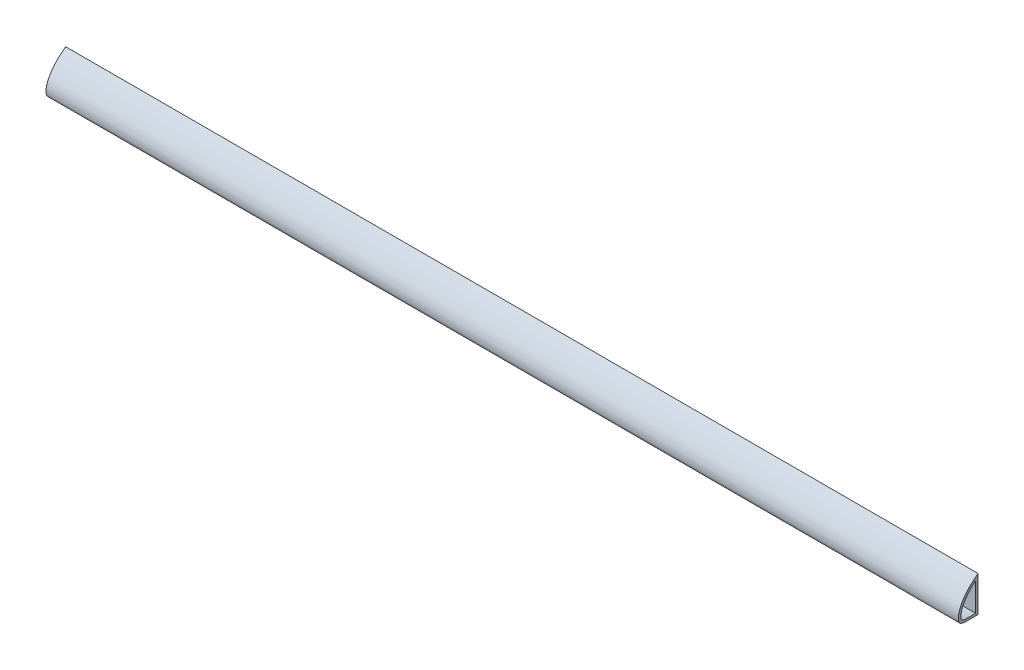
ISO-10303-21;
HEADER;
FILE_DESCRIPTION(('STEP AP214'),'2;1');
FILE_NAME('part.step','',(''),(''),'','','');
FILE_SCHEMA(('AUTOMOTIVE_DESIGN { 1 0 10303 214 1 1 1 1 }'));
ENDSEC;
DATA;
#1=APPLICATION_CONTEXT('core data for automotive mechanical design processes');
#2=APPLICATION_PROTOCOL_DEFINITION('international standard','automotive_design',2000,#1);
#3=PRODUCT_CONTEXT('',#1,'mechanical');
#4=PRODUCT('Part','Part','',(#3));
#5=PRODUCT_RELATED_PRODUCT_CATEGORY('part','',(#4));
#6=PRODUCT_DEFINITION_FORMATION('','',#4);
#7=PRODUCT_DEFINITION_CONTEXT('part definition',#1,'design');
#8=PRODUCT_DEFINITION('design','',#6,#7);
#9=PRODUCT_DEFINITION_SHAPE('','',#8);
#10=(LENGTH_UNIT() NAMED_UNIT(*) SI_UNIT(.MILLI.,.METRE.));
#11=(NAMED_UNIT(*) PLANE_ANGLE_UNIT() SI_UNIT($,.RADIAN.));
#12=(NAMED_UNIT(*) SI_UNIT($,.STERADIAN.) SOLID_ANGLE_UNIT());
#13=UNCERTAINTY_MEASURE_WITH_UNIT(LENGTH_MEASURE(1.E-05),#10,'distance_accuracy_value','');
#14=(GEOMETRIC_REPRESENTATION_CONTEXT(3) GLOBAL_UNCERTAINTY_ASSIGNED_CONTEXT((#13)) GLOBAL_UNIT_ASSIGNED_CONTEXT((#10,
#11,#12)) REPRESENTATION_CONTEXT('',''));
#15=CARTESIAN_POINT('',(0.,0.,0.));
#16=DIRECTION('',(0.,0.,1.));
#17=DIRECTION('',(1.,0.,0.));
#18=AXIS2_PLACEMENT_3D('',#15,#16,#17);
#19=CARTESIAN_POINT('',(147.6375,1.90916005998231,-0.33356018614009));
#20=DIRECTION('',(-1.,0.,0.));
#21=DIRECTION('',(0.,0.,1.));
#22=AXIS2_PLACEMENT_3D('',#19,#20,#21);
#23=PLANE('',#22);
#24=CARTESIAN_POINT('',(147.6375,9.31142365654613,-6.35));
#25=CARTESIAN_POINT('',(147.6375,9.13251287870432,-6.10940572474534));
#26=CARTESIAN_POINT('',(147.6375,8.49619410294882,-5.27830195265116));
#27=CARTESIAN_POINT('',(147.6375,7.38289954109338,-3.96958394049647));
#28=CARTESIAN_POINT('',(147.6375,5.91107497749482,-2.57710308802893));
#29=CARTESIAN_POINT('',(147.6375,4.43364850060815,-1.50738075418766));
#30=CARTESIAN_POINT('',(147.6375,2.99622308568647,-0.717084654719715));
#31=CARTESIAN_POINT('',(147.6375,1.63137185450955,-0.210435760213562));
#32=CARTESIAN_POINT('',(147.6375,0.371536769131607,0.031192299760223));
#33=CARTESIAN_POINT('',(147.6375,-0.694071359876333,-0.0149978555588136));
#34=CARTESIAN_POINT('',(147.6375,-1.67148547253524,-0.289002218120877));
#35=CARTESIAN_POINT('',(147.6375,-2.15698520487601,-1.30860402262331));
#36=CARTESIAN_POINT('',(147.6375,-2.22552208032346,-2.67967317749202));
#37=CARTESIAN_POINT('',(147.6375,-2.28727419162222,-4.41839355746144));
#38=CARTESIAN_POINT('',(147.6375,-2.24222608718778,-5.69787493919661));
#39=CARTESIAN_POINT('',(147.6375,-2.21046306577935,-6.35));
#40=B_SPLINE_CURVE_WITH_KNOTS('',3,(#24,#25,#26,#27,#28,#29,#30,#31,#32,#33,#34,#35,#36,#37,#38,
#39),.UNSPECIFIED.,.F.,.F.,(4,1,1,1,1,1,1,1,1,1,1,1,1,4),(0.473049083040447,0.475988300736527,
0.48330896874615,0.489874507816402,0.495803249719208,0.501149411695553,0.50590307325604,
0.510046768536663,0.513579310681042,0.516446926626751,0.519350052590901,0.523823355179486,
0.529973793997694,0.536375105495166),.UNSPECIFIED.);
#41=CARTESIAN_POINT('',(147.6375,9.31142365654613,-6.35));
#42=VERTEX_POINT('',#41);
#43=CARTESIAN_POINT('',(147.6375,-2.21046306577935,-6.35));
#44=VERTEX_POINT('',#43);
#45=EDGE_CURVE('E118',#42,#44,#40,.T.);
#46=ORIENTED_EDGE('',*,*,#45,.T.);
#47=DIRECTION('',(0.,1.,0.));
#48=VECTOR('',#47,1.);
#49=CARTESIAN_POINT('',(147.6375,9.31142365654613,-6.35));
#50=LINE('',#49,#48);
#51=EDGE_CURVE('E122',#44,#42,#50,.T.);
#52=ORIENTED_EDGE('',*,*,#51,.T.);
#53=EDGE_LOOP('',(#46,#52));
#54=FACE_BOUND('',#53,.T.);
#55=CARTESIAN_POINT('',(147.6375,7.67798740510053,-5.55625000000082));
#56=CARTESIAN_POINT('',(147.6375,7.24256500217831,-5.03436126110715));
#57=CARTESIAN_POINT('',(147.6375,6.32227000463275,-4.01853736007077));
#58=CARTESIAN_POINT('',(147.6375,4.80393100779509,-2.70742646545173));
#59=CARTESIAN_POINT('',(147.6375,3.38731761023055,-1.80935606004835));
#60=CARTESIAN_POINT('',(147.6375,2.20087156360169,-1.2616477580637));
#61=CARTESIAN_POINT('',(147.6375,1.28068475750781,-0.954864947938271));
#62=CARTESIAN_POINT('',(147.6375,0.508823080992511,-0.808236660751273));
#63=CARTESIAN_POINT('',(147.6375,-0.0740297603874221,-0.786056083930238));
#64=CARTESIAN_POINT('',(147.6375,-0.506497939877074,-0.81982907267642));
#65=CARTESIAN_POINT('',(147.6375,-0.872935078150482,-0.893336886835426));
#66=CARTESIAN_POINT('',(147.6375,-1.03771034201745,-0.966729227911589));
#67=CARTESIAN_POINT('',(147.6375,-1.07749251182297,-0.994978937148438));
#68=CARTESIAN_POINT('',(147.6375,-1.12571890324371,-1.04715380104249));
#69=CARTESIAN_POINT('',(147.6375,-1.22090609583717,-1.21040311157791));
#70=CARTESIAN_POINT('',(147.6375,-1.3684810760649,-1.65630650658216));
#71=CARTESIAN_POINT('',(147.6375,-1.42049440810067,-2.41400704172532));
#72=CARTESIAN_POINT('',(147.6375,-1.46024320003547,-3.4976355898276));
#73=CARTESIAN_POINT('',(147.6375,-1.47757442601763,-4.51804345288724));
#74=CARTESIAN_POINT('',(147.6375,-1.46152506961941,-5.21140755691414));
#75=CARTESIAN_POINT('',(147.6375,-1.44957232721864,-5.55625000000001));
#76=B_SPLINE_CURVE_WITH_KNOTS('',3,(#55,#56,#57,#58,#59,#60,#61,#62,#63,#64,#65,#66,#67,#68,#69,
#70,#71,#72,#73,#74,#75),.UNSPECIFIED.,.F.,.F.,(4,1,1,1,1,1,1,1,1,1,1,1,1,1,1,1,1,1,4),
(0.478462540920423,0.485388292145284,0.492314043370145,0.499239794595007,0.502702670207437,
0.506165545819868,0.509628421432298,0.511359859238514,0.513091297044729,0.514822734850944,
0.515688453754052,0.51655417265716,0.517419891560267,0.518285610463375,0.52001704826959,
0.523479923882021,0.526942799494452,0.530405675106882,0.533868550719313),.UNSPECIFIED.);
#77=CARTESIAN_POINT('',(147.6375,7.67798740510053,-5.55625000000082));
#78=VERTEX_POINT('',#77);
#79=CARTESIAN_POINT('',(147.6375,-1.44957232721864,-5.55625000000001));
#80=VERTEX_POINT('',#79);
#81=EDGE_CURVE('E80',#78,#80,#76,.T.);
#82=ORIENTED_EDGE('',*,*,#81,.F.);
#83=DIRECTION('',(0.,1.,0.));
#84=VECTOR('',#83,1.);
#85=CARTESIAN_POINT('',(147.6375,7.67798740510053,-5.55625000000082));
#86=LINE('',#85,#84);
#87=EDGE_CURVE('E74',#80,#78,#86,.T.);
#88=ORIENTED_EDGE('',*,*,#87,.F.);
#89=EDGE_LOOP('',(#82,#88));
#90=FACE_BOUND('',#89,.T.);
#91=ADVANCED_FACE('F33',(#54,#90),#23,.F.);
#92=CARTESIAN_POINT('',(-147.6375,1.90916005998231,-0.33356018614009));
#93=DIRECTION('',(-1.,0.,0.));
#94=DIRECTION('',(0.,0.,1.));
#95=AXIS2_PLACEMENT_3D('',#92,#93,#94);
#96=PLANE('',#95);
#97=CARTESIAN_POINT('',(-147.6375,9.31142365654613,-6.35));
#98=CARTESIAN_POINT('',(-147.6375,9.13251287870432,-6.10940572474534));
#99=CARTESIAN_POINT('',(-147.6375,8.49619410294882,-5.27830195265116));
#100=CARTESIAN_POINT('',(-147.6375,7.38289954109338,-3.96958394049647));
#101=CARTESIAN_POINT('',(-147.6375,5.91107497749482,-2.57710308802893));
#102=CARTESIAN_POINT('',(-147.6375,4.43364850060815,-1.50738075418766));
#103=CARTESIAN_POINT('',(-147.6375,2.99622308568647,-0.717084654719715));
#104=CARTESIAN_POINT('',(-147.6375,1.63137185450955,-0.210435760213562));
#105=CARTESIAN_POINT('',(-147.6375,0.371536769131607,0.031192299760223));
#106=CARTESIAN_POINT('',(-147.6375,-0.694071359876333,-0.0149978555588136));
#107=CARTESIAN_POINT('',(-147.6375,-1.67148547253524,-0.289002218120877));
#108=CARTESIAN_POINT('',(-147.6375,-2.15698520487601,-1.30860402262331));
#109=CARTESIAN_POINT('',(-147.6375,-2.22552208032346,-2.67967317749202));
#110=CARTESIAN_POINT('',(-147.6375,-2.28727419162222,-4.41839355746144));
#111=CARTESIAN_POINT('',(-147.6375,-2.24222608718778,-5.69787493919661));
#112=CARTESIAN_POINT('',(-147.6375,-2.21046306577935,-6.35));
#113=B_SPLINE_CURVE_WITH_KNOTS('',3,(#97,#98,#99,#100,#101,#102,#103,#104,#105,#106,#107,#108,
#109,#110,#111,#112),.UNSPECIFIED.,.F.,.F.,(4,1,1,1,1,1,1,1,1,1,1,1,1,4),(0.473049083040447,
0.475988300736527,0.48330896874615,0.489874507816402,0.495803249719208,0.501149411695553,
0.50590307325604,0.510046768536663,0.513579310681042,0.516446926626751,0.519350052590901,
0.523823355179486,0.529973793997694,0.536375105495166),.UNSPECIFIED.);
#114=CARTESIAN_POINT('',(-147.6375,9.31142365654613,-6.35));
#115=VERTEX_POINT('',#114);
#116=CARTESIAN_POINT('',(-147.6375,-2.21046306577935,-6.35));
#117=VERTEX_POINT('',#116);
#118=EDGE_CURVE('E119',#115,#117,#113,.T.);
#119=ORIENTED_EDGE('',*,*,#118,.F.);
#120=DIRECTION('',(0.,1.,0.));
#121=VECTOR('',#120,1.);
#122=CARTESIAN_POINT('',(-147.6375,9.31142365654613,-6.35));
#123=LINE('',#122,#121);
#124=EDGE_CURVE('E112',#117,#115,#123,.T.);
#125=ORIENTED_EDGE('',*,*,#124,.F.);
#126=EDGE_LOOP('',(#119,#125));
#127=FACE_BOUND('',#126,.T.);
#128=DIRECTION('',(0.,1.,0.));
#129=VECTOR('',#128,1.);
#130=CARTESIAN_POINT('',(-147.6375,7.67798740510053,-5.55625000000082));
#131=LINE('',#130,#129);
#132=CARTESIAN_POINT('',(-147.6375,-1.44957232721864,-5.55625000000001));
#133=VERTEX_POINT('',#132);
#134=CARTESIAN_POINT('',(-147.6375,7.67798740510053,-5.55625000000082));
#135=VERTEX_POINT('',#134);
#136=EDGE_CURVE('E84',#133,#135,#131,.T.);
#137=ORIENTED_EDGE('',*,*,#136,.T.);
#138=CARTESIAN_POINT('',(-147.6375,7.67798740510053,-5.55625000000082));
#139=CARTESIAN_POINT('',(-147.6375,7.24256500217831,-5.03436126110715));
#140=CARTESIAN_POINT('',(-147.6375,6.32227000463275,-4.01853736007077));
#141=CARTESIAN_POINT('',(-147.6375,4.80393100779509,-2.70742646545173));
#142=CARTESIAN_POINT('',(-147.6375,3.38731761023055,-1.80935606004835));
#143=CARTESIAN_POINT('',(-147.6375,2.20087156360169,-1.2616477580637));
#144=CARTESIAN_POINT('',(-147.6375,1.28068475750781,-0.954864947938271));
#145=CARTESIAN_POINT('',(-147.6375,0.508823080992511,-0.808236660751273));
#146=CARTESIAN_POINT('',(-147.6375,-0.0740297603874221,-0.786056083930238));
#147=CARTESIAN_POINT('',(-147.6375,-0.506497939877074,-0.81982907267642));
#148=CARTESIAN_POINT('',(-147.6375,-0.872935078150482,-0.893336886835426));
#149=CARTESIAN_POINT('',(-147.6375,-1.03771034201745,-0.966729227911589));
#150=CARTESIAN_POINT('',(-147.6375,-1.07749251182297,-0.994978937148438));
#151=CARTESIAN_POINT('',(-147.6375,-1.12571890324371,-1.04715380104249));
#152=CARTESIAN_POINT('',(-147.6375,-1.22090609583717,-1.21040311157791));
#153=CARTESIAN_POINT('',(-147.6375,-1.3684810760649,-1.65630650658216));
#154=CARTESIAN_POINT('',(-147.6375,-1.42049440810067,-2.41400704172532));
#155=CARTESIAN_POINT('',(-147.6375,-1.46024320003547,-3.4976355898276));
#156=CARTESIAN_POINT('',(-147.6375,-1.47757442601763,-4.51804345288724));
#157=CARTESIAN_POINT('',(-147.6375,-1.46152506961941,-5.21140755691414));
#158=CARTESIAN_POINT('',(-147.6375,-1.44957232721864,-5.55625000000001));
#159=B_SPLINE_CURVE_WITH_KNOTS('',3,(#138,#139,#140,#141,#142,#143,#144,#145,#146,#147,#148,
#149,#150,#151,#152,#153,#154,#155,#156,#157,#158),.UNSPECIFIED.,.F.,.F.,(4,1,1,1,1,1,1,1,1,1,1,
1,1,1,1,1,1,1,4),(0.478462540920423,0.485388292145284,0.492314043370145,0.499239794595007,
0.502702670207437,0.506165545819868,0.509628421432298,0.511359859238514,0.513091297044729,
0.514822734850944,0.515688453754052,0.51655417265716,0.517419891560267,0.518285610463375,
0.52001704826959,0.523479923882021,0.526942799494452,0.530405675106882,0.533868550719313),.UNSPECIFIED.);
#160=EDGE_CURVE('E56',#135,#133,#159,.T.);
#161=ORIENTED_EDGE('',*,*,#160,.T.);
#162=EDGE_LOOP('',(#137,#161));
#163=FACE_BOUND('',#162,.T.);
#164=ADVANCED_FACE('F101',(#127,#163),#96,.T.);
#165=DIRECTION('',(-1.,0.,0.));
#166=VECTOR('',#165,1.);
#167=SURFACE_OF_LINEAR_EXTRUSION('',#40,#166);
#168=ORIENTED_EDGE('',*,*,#118,.T.);
#169=DIRECTION('',(-1.,0.,0.));
#170=VECTOR('',#169,1.);
#171=CARTESIAN_POINT('',(147.6375,-2.21046306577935,-6.35));
#172=LINE('',#171,#170);
#173=EDGE_CURVE('E11',#44,#117,#172,.T.);
#174=ORIENTED_EDGE('',*,*,#173,.F.);
#175=ORIENTED_EDGE('',*,*,#45,.F.);
#176=DIRECTION('',(-1.,0.,0.));
#177=VECTOR('',#176,1.);
#178=CARTESIAN_POINT('',(147.6375,9.31142365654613,-6.35));
#179=LINE('',#178,#177);
#180=EDGE_CURVE('E42',#42,#115,#179,.T.);
#181=ORIENTED_EDGE('',*,*,#180,.T.);
#182=EDGE_LOOP('',(#168,#174,#175,#181));
#183=FACE_BOUND('',#182,.T.);
#184=ADVANCED_FACE('F35',(#183),#167,.F.);
#185=CARTESIAN_POINT('',(147.6375,9.31142365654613,-6.35));
#186=DIRECTION('',(0.,0.,1.));
#187=DIRECTION('',(0.,-1.,0.));
#188=AXIS2_PLACEMENT_3D('',#185,#186,#187);
#189=PLANE('',#188);
#190=ORIENTED_EDGE('',*,*,#124,.T.);
#191=ORIENTED_EDGE('',*,*,#180,.F.);
#192=ORIENTED_EDGE('',*,*,#51,.F.);
#193=ORIENTED_EDGE('',*,*,#173,.T.);
#194=EDGE_LOOP('',(#190,#191,#192,#193));
#195=FACE_BOUND('',#194,.T.);
#196=ADVANCED_FACE('F98',(#195),#189,.F.);
#197=DIRECTION('',(-1.,0.,0.));
#198=VECTOR('',#197,1.);
#199=SURFACE_OF_LINEAR_EXTRUSION('',#76,#198);
#200=ORIENTED_EDGE('',*,*,#160,.F.);
#201=DIRECTION('',(-1.,0.,0.));
#202=VECTOR('',#201,1.);
#203=CARTESIAN_POINT('',(147.6375,7.67798740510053,-5.55625000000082));
#204=LINE('',#203,#202);
#205=EDGE_CURVE('E76',#78,#135,#204,.T.);
#206=ORIENTED_EDGE('',*,*,#205,.F.);
#207=ORIENTED_EDGE('',*,*,#81,.T.);
#208=DIRECTION('',(-1.,0.,0.));
#209=VECTOR('',#208,1.);
#210=CARTESIAN_POINT('',(147.6375,-1.44957232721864,-5.55625000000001));
#211=LINE('',#210,#209);
#212=EDGE_CURVE('E49',#80,#133,#211,.T.);
#213=ORIENTED_EDGE('',*,*,#212,.T.);
#214=EDGE_LOOP('',(#200,#206,#207,#213));
#215=FACE_BOUND('',#214,.T.);
#216=ADVANCED_FACE('F82',(#215),#199,.T.);
#217=CARTESIAN_POINT('',(147.6375,7.67798740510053,-5.55625000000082));
#218=DIRECTION('',(0.,0.,1.));
#219=DIRECTION('',(0.,-1.,0.));
#220=AXIS2_PLACEMENT_3D('',#217,#218,#219);
#221=PLANE('',#220);
#222=ORIENTED_EDGE('',*,*,#136,.F.);
#223=ORIENTED_EDGE('',*,*,#212,.F.);
#224=ORIENTED_EDGE('',*,*,#87,.T.);
#225=ORIENTED_EDGE('',*,*,#205,.T.);
#226=EDGE_LOOP('',(#222,#223,#224,#225));
#227=FACE_BOUND('',#226,.T.);
#228=ADVANCED_FACE('F75',(#227),#221,.T.);
#229=CLOSED_SHELL('',(#91,#164,#184,#196,#216,#228));
#230=MANIFOLD_SOLID_BREP('B2',#229);
#231=ADVANCED_BREP_SHAPE_REPRESENTATION('',(#18,#230),#14);
#232=SHAPE_DEFINITION_REPRESENTATION(#9,#231);
ENDSEC;
END-ISO-10303-21;
